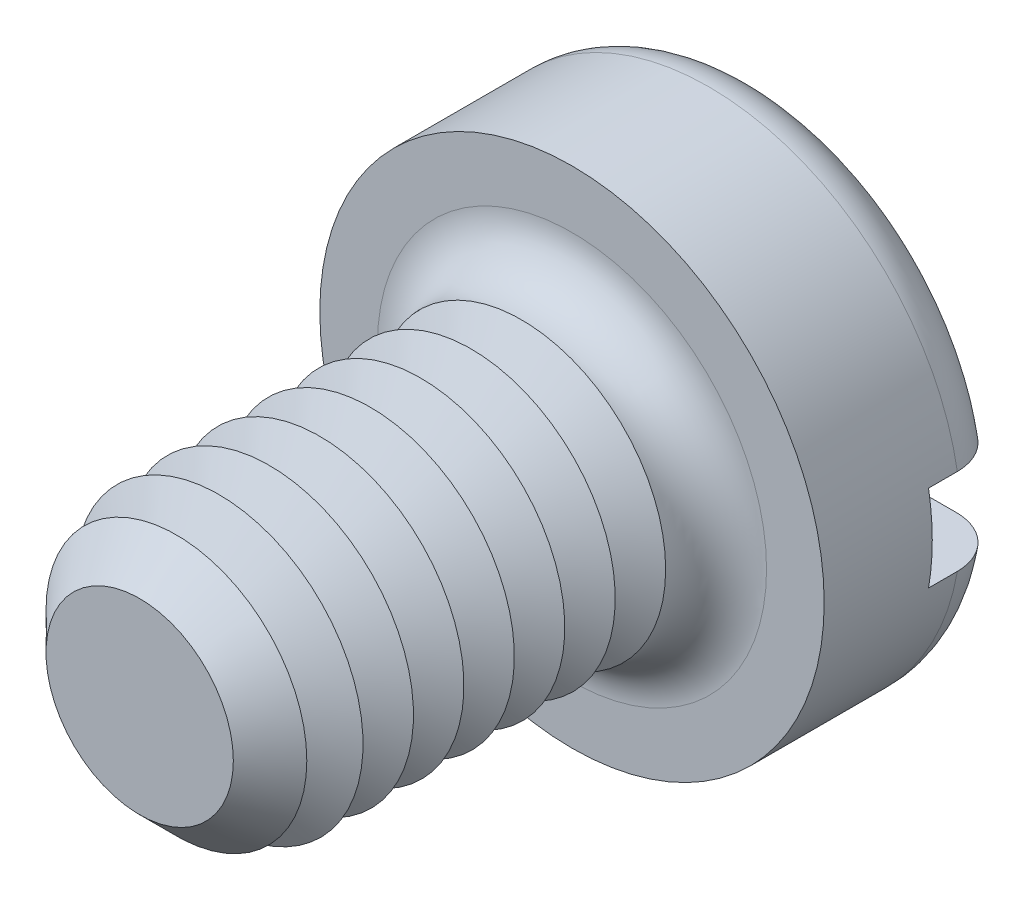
ISO-10303-21;
HEADER;
FILE_DESCRIPTION(('STEP AP214'),'2;1');
FILE_NAME('part.step','',(''),(''),'','','');
FILE_SCHEMA(('AUTOMOTIVE_DESIGN { 1 0 10303 214 1 1 1 1 }'));
ENDSEC;
DATA;
#1=APPLICATION_CONTEXT('core data for automotive mechanical design processes');
#2=APPLICATION_PROTOCOL_DEFINITION('international standard','automotive_design',2000,#1);
#3=PRODUCT_CONTEXT('',#1,'mechanical');
#4=PRODUCT('Part','Part','',(#3));
#5=PRODUCT_RELATED_PRODUCT_CATEGORY('part','',(#4));
#6=PRODUCT_DEFINITION_FORMATION('','',#4);
#7=PRODUCT_DEFINITION_CONTEXT('part definition',#1,'design');
#8=PRODUCT_DEFINITION('design','',#6,#7);
#9=PRODUCT_DEFINITION_SHAPE('','',#8);
#10=(LENGTH_UNIT() NAMED_UNIT(*) SI_UNIT(.MILLI.,.METRE.));
#11=(NAMED_UNIT(*) PLANE_ANGLE_UNIT() SI_UNIT($,.RADIAN.));
#12=(NAMED_UNIT(*) SI_UNIT($,.STERADIAN.) SOLID_ANGLE_UNIT());
#13=UNCERTAINTY_MEASURE_WITH_UNIT(LENGTH_MEASURE(1.E-05),#10,'distance_accuracy_value','');
#14=(GEOMETRIC_REPRESENTATION_CONTEXT(3) GLOBAL_UNCERTAINTY_ASSIGNED_CONTEXT((#13)) GLOBAL_UNIT_ASSIGNED_CONTEXT((#10,
#11,#12)) REPRESENTATION_CONTEXT('',''));
#15=CARTESIAN_POINT('',(0.,0.,0.));
#16=DIRECTION('',(0.,0.,1.));
#17=DIRECTION('',(1.,0.,0.));
#18=AXIS2_PLACEMENT_3D('',#15,#16,#17);
#19=CARTESIAN_POINT('',(0.,0.,-2.6));
#20=DIRECTION('',(0.,0.,1.));
#21=DIRECTION('',(1.,0.,0.));
#22=AXIS2_PLACEMENT_3D('',#19,#20,#21);
#23=PLANE('',#22);
#24=CARTESIAN_POINT('',(0.,0.,-2.6));
#25=DIRECTION('',(0.,0.,1.));
#26=DIRECTION('',(1.,0.,0.));
#27=AXIS2_PLACEMENT_3D('',#24,#25,#26);
#28=CIRCLE('',#27,2.8);
#29=CARTESIAN_POINT('',(-2.73495886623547,0.6,-2.6));
#30=VERTEX_POINT('',#29);
#31=CARTESIAN_POINT('',(2.73495886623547,0.6,-2.6));
#32=VERTEX_POINT('',#31);
#33=EDGE_CURVE('E116',#30,#32,#28,.F.);
#34=ORIENTED_EDGE('',*,*,#33,.T.);
#35=DIRECTION('',(1.,0.,0.));
#36=VECTOR('',#35,1.);
#37=CARTESIAN_POINT('',(-3.5,0.600000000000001,-2.6));
#38=LINE('',#37,#36);
#39=EDGE_CURVE('E111',#30,#32,#38,.T.);
#40=ORIENTED_EDGE('',*,*,#39,.F.);
#41=EDGE_LOOP('',(#34,#40));
#42=FACE_BOUND('',#41,.T.);
#43=ADVANCED_FACE('F39',(#42),#23,.F.);
#44=CARTESIAN_POINT('',(0.,0.,-1.9));
#45=DIRECTION('',(0.,0.,1.));
#46=DIRECTION('',(1.,0.,0.));
#47=AXIS2_PLACEMENT_3D('',#44,#45,#46);
#48=TOROIDAL_SURFACE('',#47,2.8,0.7);
#49=CARTESIAN_POINT('',(-3.24550494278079,0.600000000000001,-2.38938679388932));
#50=CARTESIAN_POINT('',(-3.21724139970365,0.600000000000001,-2.41780774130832));
#51=CARTESIAN_POINT('',(-3.18652103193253,0.600000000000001,-2.44383169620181));
#52=CARTESIAN_POINT('',(-3.12110229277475,0.600000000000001,-2.49034599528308));
#53=CARTESIAN_POINT('',(-3.08639834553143,0.6,-2.51082844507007));
#54=CARTESIAN_POINT('',(-3.01410013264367,0.6,-2.54568075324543));
#55=CARTESIAN_POINT('',(-2.97650963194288,0.6,-2.56005841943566));
#56=CARTESIAN_POINT('',(-2.89948250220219,0.6,-2.58239238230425));
#57=CARTESIAN_POINT('',(-2.86004633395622,0.6,-2.59035027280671));
#58=CARTESIAN_POINT('',(-2.77983715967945,0.6,-2.5997577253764));
#59=CARTESIAN_POINT('',(-2.73905311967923,0.6,-2.60111317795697));
#60=CARTESIAN_POINT('',(-2.65781876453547,0.6,-2.59706866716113));
#61=CARTESIAN_POINT('',(-2.61736849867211,0.6,-2.59166772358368));
#62=CARTESIAN_POINT('',(-2.53729983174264,0.6,-2.57414594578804));
#63=CARTESIAN_POINT('',(-2.49770360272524,0.6,-2.56192363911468));
#64=CARTESIAN_POINT('',(-2.421111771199,0.6,-2.5310238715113));
#65=CARTESIAN_POINT('',(-2.38411632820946,0.6,-2.51234601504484));
#66=CARTESIAN_POINT('',(-2.31371213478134,0.6,-2.46896762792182));
#67=CARTESIAN_POINT('',(-2.28031240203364,0.6,-2.44425244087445));
#68=CARTESIAN_POINT('',(-2.21823311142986,0.6,-2.38946667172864));
#69=CARTESIAN_POINT('',(-2.18955321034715,0.6,-2.35939647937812));
#70=CARTESIAN_POINT('',(-2.13836074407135,0.6,-2.29532787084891));
#71=CARTESIAN_POINT('',(-2.11574147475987,0.6,-2.26141482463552));
#72=CARTESIAN_POINT('',(-2.07677080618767,0.6,-2.19015935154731));
#73=CARTESIAN_POINT('',(-2.06041784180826,0.6,-2.15281778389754));
#74=CARTESIAN_POINT('',(-2.03508596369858,0.6,-2.07723332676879));
#75=CARTESIAN_POINT('',(-2.02585871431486,0.6,-2.03907365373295));
#76=CARTESIAN_POINT('',(-2.01416722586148,0.6,-1.96173417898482));
#77=CARTESIAN_POINT('',(-2.01170151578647,0.6,-1.92255460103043));
#78=CARTESIAN_POINT('',(-2.01359934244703,0.6,-1.84555709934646));
#79=CARTESIAN_POINT('',(-2.01775787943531,0.6,-1.80773393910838));
#80=CARTESIAN_POINT('',(-2.03236373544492,0.6,-1.73332511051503));
#81=CARTESIAN_POINT('',(-2.04281097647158,0.6,-1.69673942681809));
#82=CARTESIAN_POINT('',(-2.06962963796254,0.6,-1.62577336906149));
#83=CARTESIAN_POINT('',(-2.08600685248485,0.6,-1.59139519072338));
#84=CARTESIAN_POINT('',(-2.12413495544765,0.6,-1.52576356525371));
#85=CARTESIAN_POINT('',(-2.14588657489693,0.6,-1.49451054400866));
#86=CARTESIAN_POINT('',(-2.19483541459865,0.6,-1.43498643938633));
#87=CARTESIAN_POINT('',(-2.22217844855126,0.6,-1.40683532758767));
#88=CARTESIAN_POINT('',(-2.28105616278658,0.6,-1.35532544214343));
#89=CARTESIAN_POINT('',(-2.3125916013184,0.6,-1.33196753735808));
#90=CARTESIAN_POINT('',(-2.38018779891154,0.6,-1.28984356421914));
#91=CARTESIAN_POINT('',(-2.41637068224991,0.6,-1.27127330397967));
#92=CARTESIAN_POINT('',(-2.49129688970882,0.6,-1.24032971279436));
#93=CARTESIAN_POINT('',(-2.53004053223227,0.6,-1.22795715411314));
#94=CARTESIAN_POINT('',(-2.6098393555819,0.6,-1.2095515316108));
#95=CARTESIAN_POINT('',(-2.65092550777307,0.6,-1.20365237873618));
#96=CARTESIAN_POINT('',(-2.7335069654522,0.6,-1.1988380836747));
#97=CARTESIAN_POINT('',(-2.7750022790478,0.6,-1.19992308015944));
#98=CARTESIAN_POINT('',(-2.85718851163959,0.6,-1.20909046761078));
#99=CARTESIAN_POINT('',(-2.8978799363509,0.6,-1.21716830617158));
#100=CARTESIAN_POINT('',(-2.97729176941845,0.6,-1.24014327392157));
#101=CARTESIAN_POINT('',(-3.01601231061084,0.6,-1.25503994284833));
#102=CARTESIAN_POINT('',(-3.08976822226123,0.6,-1.29101066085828));
#103=CARTESIAN_POINT('',(-3.12484927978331,0.600000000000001,-1.31199098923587));
#104=CARTESIAN_POINT('',(-3.19090022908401,0.600000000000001,-1.35965144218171));
#105=CARTESIAN_POINT('',(-3.22187053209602,0.600000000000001,-1.38633099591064));
#106=CARTESIAN_POINT('',(-3.2781946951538,0.600000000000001,-1.44408564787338));
#107=CARTESIAN_POINT('',(-3.3036441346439,0.600000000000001,-1.47506754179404));
#108=CARTESIAN_POINT('',(-3.34887649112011,0.600000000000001,-1.54092398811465));
#109=CARTESIAN_POINT('',(-3.36865993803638,0.600000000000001,-1.57579817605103));
#110=CARTESIAN_POINT('',(-3.40166738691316,0.600000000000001,-1.64783067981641));
#111=CARTESIAN_POINT('',(-3.41499360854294,0.600000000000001,-1.68494217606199));
#112=CARTESIAN_POINT('',(-3.43515375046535,0.600000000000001,-1.76088675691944));
#113=CARTESIAN_POINT('',(-3.44198836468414,0.600000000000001,-1.79971965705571));
#114=CARTESIAN_POINT('',(-3.44891916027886,0.600000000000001,-1.87757893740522));
#115=CARTESIAN_POINT('',(-3.44908375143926,0.600000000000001,-1.91659924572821));
#116=CARTESIAN_POINT('',(-3.44284111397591,0.600000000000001,-1.99412088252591));
#117=CARTESIAN_POINT('',(-3.43643236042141,0.600000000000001,-2.03262208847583));
#118=CARTESIAN_POINT('',(-3.41725803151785,0.600000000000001,-2.10792315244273));
#119=CARTESIAN_POINT('',(-3.40450469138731,0.600000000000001,-2.14472613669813));
#120=CARTESIAN_POINT('',(-3.3730385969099,0.600000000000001,-2.21565060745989));
#121=CARTESIAN_POINT('',(-3.35433321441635,0.600000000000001,-2.24977534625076));
#122=CARTESIAN_POINT('',(-3.3201892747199,0.600000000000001,-2.30136364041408));
#123=CARTESIAN_POINT('',(-3.30647805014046,0.600000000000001,-2.31999402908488));
#124=CARTESIAN_POINT('',(-3.27728518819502,0.600000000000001,-2.35581090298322));
#125=CARTESIAN_POINT('',(-3.26180356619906,0.600000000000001,-2.37299740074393));
#126=CARTESIAN_POINT('',(-3.24550494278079,0.600000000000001,-2.38938679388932));
#127=B_SPLINE_CURVE_WITH_KNOTS('',3,(#49,#50,#51,#52,#53,#54,#55,#56,#57,#58,#59,#60,#61,#62,
#63,#64,#65,#66,#67,#68,#69,#70,#71,#72,#73,#74,#75,#76,#77,#78,#79,#80,#81,#82,#83,#84,#85,#86,
#87,#88,#89,#90,#91,#92,#93,#94,#95,#96,#97,#98,#99,#100,#101,#102,#103,#104,#105,#106,#107,
#108,#109,#110,#111,#112,#113,#114,#115,#116,#117,#118,#119,#120,#121,#122,#123,#124,#125,#126),
.UNSPECIFIED.,.T.,.F.,(4,2,2,2,2,2,2,2,2,2,2,2,2,2,2,2,2,2,2,2,2,2,2,2,2,2,2,2,2,2,2,2,2,2,2,2,
2,2,4),(0.,0.120160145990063,0.240490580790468,0.36066665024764,0.480812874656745,
0.602666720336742,0.724538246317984,0.848272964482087,0.972015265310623,1.09606100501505,
1.2200977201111,1.34178071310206,1.46343329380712,1.58062647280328,1.6977941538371,
1.81140573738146,1.92501591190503,2.03873739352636,2.15247435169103,2.26967910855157,
2.38690509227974,2.50835551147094,2.62982106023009,2.75375450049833,2.87769040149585,
3.00154567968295,3.12539259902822,3.24742469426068,3.36944457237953,3.48914477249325,
3.60883377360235,3.72656056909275,3.84427477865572,3.96078136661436,4.07731498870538,
4.19362474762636,4.3097910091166,4.37908387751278,4.44837614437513),.UNSPECIFIED.);
#128=CARTESIAN_POINT('',(-3.44818792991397,0.600000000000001,-1.8999999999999));
#129=VERTEX_POINT('',#128);
#130=EDGE_CURVE('E241',#129,#30,#127,.T.);
#131=ORIENTED_EDGE('',*,*,#130,.F.);
#132=CARTESIAN_POINT('',(0.,0.,-1.9));
#133=DIRECTION('',(0.,0.,1.));
#134=DIRECTION('',(1.,0.,0.));
#135=AXIS2_PLACEMENT_3D('',#132,#133,#134);
#136=CIRCLE('',#135,3.5);
#137=CARTESIAN_POINT('',(3.44818792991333,0.6,-1.9));
#138=VERTEX_POINT('',#137);
#139=EDGE_CURVE('E125',#138,#129,#136,.T.);
#140=ORIENTED_EDGE('',*,*,#139,.F.);
#141=CARTESIAN_POINT('',(2.1414268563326,0.6,-2.29762171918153));
#142=CARTESIAN_POINT('',(2.16505443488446,0.6,-2.33058245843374));
#143=CARTESIAN_POINT('',(2.19155609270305,0.6,-2.36152717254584));
#144=CARTESIAN_POINT('',(2.24942944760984,0.6,-2.41852964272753));
#145=CARTESIAN_POINT('',(2.28080921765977,0.6,-2.44457913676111));
#146=CARTESIAN_POINT('',(2.34741203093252,0.6,-2.49105381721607));
#147=CARTESIAN_POINT('',(2.38262862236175,0.6,-2.51148824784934));
#148=CARTESIAN_POINT('',(2.45593176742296,0.6,-2.54626881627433));
#149=CARTESIAN_POINT('',(2.49401741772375,0.6,-2.56061686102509));
#150=CARTESIAN_POINT('',(2.57272605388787,0.6,-2.58306429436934));
#151=CARTESIAN_POINT('',(2.6133821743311,0.6,-2.59104769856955));
#152=CARTESIAN_POINT('',(2.6954618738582,0.6,-2.60009608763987));
#153=CARTESIAN_POINT('',(2.73688552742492,0.6,-2.60116039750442));
#154=CARTESIAN_POINT('',(2.81941950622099,0.6,-2.5962925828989));
#155=CARTESIAN_POINT('',(2.86052888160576,0.6,-2.59034422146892));
#156=CARTESIAN_POINT('',(2.94113709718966,0.6,-2.57153687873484));
#157=CARTESIAN_POINT('',(2.98063603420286,0.6,-2.55867831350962));
#158=CARTESIAN_POINT('',(3.05633735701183,0.6,-2.52657771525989));
#159=CARTESIAN_POINT('',(3.09257627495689,0.6,-2.50742188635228));
#160=CARTESIAN_POINT('',(3.16123898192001,0.6,-2.46318606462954));
#161=CARTESIAN_POINT('',(3.19366316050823,0.6,-2.4381066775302));
#162=CARTESIAN_POINT('',(3.25312278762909,0.6,-2.38324481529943));
#163=CARTESIAN_POINT('',(3.28024842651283,0.6,-2.35356008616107));
#164=CARTESIAN_POINT('',(3.32902587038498,0.6,-2.28998971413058));
#165=CARTESIAN_POINT('',(3.35067820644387,0.6,-2.25610447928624));
#166=CARTESIAN_POINT('',(3.38751207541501,0.6,-2.18572286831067));
#167=CARTESIAN_POINT('',(3.40279804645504,0.6,-2.14928112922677));
#168=CARTESIAN_POINT('',(3.42695590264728,0.6,-2.07433042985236));
#169=CARTESIAN_POINT('',(3.43582824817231,0.6,-2.03582161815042));
#170=CARTESIAN_POINT('',(3.44682113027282,0.6,-1.95829536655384));
#171=CARTESIAN_POINT('',(3.44901648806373,0.6,-1.91928851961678));
#172=CARTESIAN_POINT('',(3.44680085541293,0.6,-1.84146366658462));
#173=CARTESIAN_POINT('',(3.44239008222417,0.6,-1.80264565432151));
#174=CARTESIAN_POINT('',(3.42712544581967,0.6,-1.72644634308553));
#175=CARTESIAN_POINT('',(3.41629508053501,0.6,-1.6890603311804));
#176=CARTESIAN_POINT('',(3.38853757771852,0.6,-1.61662604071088));
#177=CARTESIAN_POINT('',(3.37161039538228,0.6,-1.58157777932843));
#178=CARTESIAN_POINT('',(3.33207798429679,0.6,-1.51464178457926));
#179=CARTESIAN_POINT('',(3.30944854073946,0.6,-1.48276835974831));
#180=CARTESIAN_POINT('',(3.2592165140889,0.6,-1.42321861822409));
#181=CARTESIAN_POINT('',(3.23161370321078,0.6,-1.3955424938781));
#182=CARTESIAN_POINT('',(3.17188519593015,0.6,-1.34481834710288));
#183=CARTESIAN_POINT('',(3.13971065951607,0.6,-1.32182785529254));
#184=CARTESIAN_POINT('',(3.07201123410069,0.6,-1.28147003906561));
#185=CARTESIAN_POINT('',(3.03648608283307,0.6,-1.26410315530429));
#186=CARTESIAN_POINT('',(2.962449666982,0.6,-1.2351645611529));
#187=CARTESIAN_POINT('',(2.92389781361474,0.6,-1.22369671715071));
#188=CARTESIAN_POINT('',(2.84543273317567,0.6,-1.20726565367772));
#189=CARTESIAN_POINT('',(2.80551936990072,0.6,-1.20230308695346));
#190=CARTESIAN_POINT('',(2.72467191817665,0.6,-1.1989357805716));
#191=CARTESIAN_POINT('',(2.68373266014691,0.6,-1.20065484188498));
#192=CARTESIAN_POINT('',(2.60270222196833,0.6,-1.21084560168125));
#193=CARTESIAN_POINT('',(2.56261112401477,0.6,-1.21931795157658));
#194=CARTESIAN_POINT('',(2.48385954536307,0.6,-1.24292934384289));
#195=CARTESIAN_POINT('',(2.44522508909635,0.6,-1.25815531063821));
#196=CARTESIAN_POINT('',(2.37106165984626,0.6,-1.29488663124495));
#197=CARTESIAN_POINT('',(2.33553282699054,0.6,-1.31639226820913));
#198=CARTESIAN_POINT('',(2.2686996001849,0.6,-1.36507949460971));
#199=CARTESIAN_POINT('',(2.23738745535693,0.6,-1.39225042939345));
#200=CARTESIAN_POINT('',(2.17990424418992,0.6,-1.45157941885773));
#201=CARTESIAN_POINT('',(2.15373259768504,0.6,-1.48373691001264));
#202=CARTESIAN_POINT('',(2.10799355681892,0.6,-1.551327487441));
#203=CARTESIAN_POINT('',(2.08828258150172,0.6,-1.58666329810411));
#204=CARTESIAN_POINT('',(2.05534440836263,0.6,-1.66023600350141));
#205=CARTESIAN_POINT('',(2.042115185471,0.6,-1.6984719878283));
#206=CARTESIAN_POINT('',(2.02303126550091,0.6,-1.77519783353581));
#207=CARTESIAN_POINT('',(2.01691541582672,0.6,-1.8136228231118));
#208=CARTESIAN_POINT('',(2.01140375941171,0.6,-1.89096056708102));
#209=CARTESIAN_POINT('',(2.01200856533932,0.6,-1.92987336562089));
#210=CARTESIAN_POINT('',(2.01981617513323,0.6,-2.006065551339));
#211=CARTESIAN_POINT('',(2.02685835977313,0.6,-2.04336165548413));
#212=CARTESIAN_POINT('',(2.0470502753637,0.6,-2.1162250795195));
#213=CARTESIAN_POINT('',(2.06019252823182,0.6,-2.15179445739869));
#214=CARTESIAN_POINT('',(2.08525738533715,0.6,-2.20558874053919));
#215=CARTESIAN_POINT('',(2.09529161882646,0.6,-2.22471751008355));
#216=CARTESIAN_POINT('',(2.11708813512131,0.6,-2.26196179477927));
#217=CARTESIAN_POINT('',(2.12885034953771,0.6,-2.28007734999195));
#218=CARTESIAN_POINT('',(2.1414268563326,0.6,-2.29762171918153));
#219=B_SPLINE_CURVE_WITH_KNOTS('',3,(#141,#142,#143,#144,#145,#146,#147,#148,#149,#150,#151,
#152,#153,#154,#155,#156,#157,#158,#159,#160,#161,#162,#163,#164,#165,#166,#167,#168,#169,#170,
#171,#172,#173,#174,#175,#176,#177,#178,#179,#180,#181,#182,#183,#184,#185,#186,#187,#188,#189,
#190,#191,#192,#193,#194,#195,#196,#197,#198,#199,#200,#201,#202,#203,#204,#205,#206,#207,#208,
#209,#210,#211,#212,#213,#214,#215,#216,#217,#218),.UNSPECIFIED.,.T.,.F.,(4,2,2,2,2,2,2,2,2,2,2,
2,2,2,2,2,2,2,2,2,2,2,2,2,2,2,2,2,2,2,2,2,2,2,2,2,2,2,4),(0.,0.121582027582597,
0.243367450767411,0.364951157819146,0.486496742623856,0.610209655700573,0.733934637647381,
0.857946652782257,0.981951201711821,1.1043243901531,1.22668507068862,1.34673532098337,
1.46677391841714,1.58475736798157,1.70273234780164,1.81938035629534,1.93602452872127,
2.05224435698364,2.168465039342,2.28518782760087,2.40191596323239,2.52000081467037,
2.63809491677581,2.75820270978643,2.87832255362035,3.00067856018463,3.1230463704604,
3.24703703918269,3.37103329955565,3.49479843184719,3.6185495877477,3.73932715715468,
3.86006696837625,3.9762182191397,4.09238005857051,4.2057203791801,4.31892212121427,
4.38364046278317,4.44835624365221),.UNSPECIFIED.);
#220=EDGE_CURVE('E243',#32,#138,#219,.T.);
#221=ORIENTED_EDGE('',*,*,#220,.F.);
#222=ORIENTED_EDGE('',*,*,#33,.F.);
#223=EDGE_LOOP('',(#131,#140,#221,#222));
#224=FACE_BOUND('',#223,.T.);
#225=ADVANCED_FACE('F225',(#224),#48,.T.);
#226=CARTESIAN_POINT('',(0.,0.,-2.6));
#227=DIRECTION('',(0.,0.,1.));
#228=DIRECTION('',(1.,0.,0.));
#229=AXIS2_PLACEMENT_3D('',#226,#227,#228);
#230=CYLINDRICAL_SURFACE('',#229,3.5);
#231=DIRECTION('',(0.,0.,1.));
#232=VECTOR('',#231,1.);
#233=CARTESIAN_POINT('',(3.44818792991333,0.6,-2.6));
#234=LINE('',#233,#232);
#235=CARTESIAN_POINT('',(3.44818792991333,0.6,-1.5));
#236=VERTEX_POINT('',#235);
#237=EDGE_CURVE('E257',#138,#236,#234,.T.);
#238=ORIENTED_EDGE('',*,*,#237,.F.);
#239=ORIENTED_EDGE('',*,*,#139,.T.);
#240=DIRECTION('',(0.,0.,1.));
#241=VECTOR('',#240,1.);
#242=CARTESIAN_POINT('',(-3.44818792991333,0.600000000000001,-2.6));
#243=LINE('',#242,#241);
#244=CARTESIAN_POINT('',(-3.44818792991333,0.600000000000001,-1.5));
#245=VERTEX_POINT('',#244);
#246=EDGE_CURVE('E63',#245,#129,#243,.F.);
#247=ORIENTED_EDGE('',*,*,#246,.F.);
#248=CARTESIAN_POINT('',(0.,0.,-1.5));
#249=DIRECTION('',(0.,0.,-1.));
#250=DIRECTION('',(-1.,0.,0.));
#251=AXIS2_PLACEMENT_3D('',#248,#249,#250);
#252=CIRCLE('',#251,3.5);
#253=CARTESIAN_POINT('',(-3.44818792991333,-0.599999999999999,-1.5));
#254=VERTEX_POINT('',#253);
#255=EDGE_CURVE('E43',#245,#254,#252,.F.);
#256=ORIENTED_EDGE('',*,*,#255,.T.);
#257=DIRECTION('',(0.,0.,1.));
#258=VECTOR('',#257,1.);
#259=CARTESIAN_POINT('',(-3.44818792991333,-0.599999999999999,-2.6));
#260=LINE('',#259,#258);
#261=CARTESIAN_POINT('',(-3.44818792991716,-0.599999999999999,-1.90000000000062));
#262=VERTEX_POINT('',#261);
#263=EDGE_CURVE('E254',#262,#254,#260,.T.);
#264=ORIENTED_EDGE('',*,*,#263,.F.);
#265=CARTESIAN_POINT('',(3.44818792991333,-0.6,-1.9));
#266=VERTEX_POINT('',#265);
#267=EDGE_CURVE('E127',#262,#266,#136,.T.);
#268=ORIENTED_EDGE('',*,*,#267,.T.);
#269=DIRECTION('',(0.,0.,1.));
#270=VECTOR('',#269,1.);
#271=CARTESIAN_POINT('',(3.44818792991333,-0.6,-2.6));
#272=LINE('',#271,#270);
#273=CARTESIAN_POINT('',(3.44818792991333,-0.6,-1.5));
#274=VERTEX_POINT('',#273);
#275=EDGE_CURVE('E55',#274,#266,#272,.F.);
#276=ORIENTED_EDGE('',*,*,#275,.F.);
#277=EDGE_CURVE('E11',#274,#236,#252,.F.);
#278=ORIENTED_EDGE('',*,*,#277,.T.);
#279=EDGE_LOOP('',(#238,#239,#247,#256,#264,#268,#276,#278));
#280=FACE_BOUND('',#279,.T.);
#281=CARTESIAN_POINT('',(0.,0.,0.));
#282=DIRECTION('',(0.,0.,1.));
#283=DIRECTION('',(1.,0.,0.));
#284=AXIS2_PLACEMENT_3D('',#281,#282,#283);
#285=CIRCLE('',#284,3.5);
#286=CARTESIAN_POINT('',(3.5,0.,0.));
#287=VERTEX_POINT('',#286);
#288=EDGE_CURVE('E259',#287,#287,#285,.T.);
#289=ORIENTED_EDGE('',*,*,#288,.F.);
#290=EDGE_LOOP('',(#289));
#291=FACE_BOUND('',#290,.T.);
#292=ADVANCED_FACE('F221',(#280,#291),#230,.T.);
#293=CARTESIAN_POINT('',(2.73495886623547,-0.6,-2.6));
#294=VERTEX_POINT('',#293);
#295=CARTESIAN_POINT('',(-2.73495886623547,-0.6,-2.6));
#296=VERTEX_POINT('',#295);
#297=EDGE_CURVE('E109',#294,#296,#28,.F.);
#298=ORIENTED_EDGE('',*,*,#297,.T.);
#299=DIRECTION('',(-1.,0.,0.));
#300=VECTOR('',#299,1.);
#301=CARTESIAN_POINT('',(-3.5,-0.599999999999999,-2.6));
#302=LINE('',#301,#300);
#303=EDGE_CURVE('E96',#294,#296,#302,.T.);
#304=ORIENTED_EDGE('',*,*,#303,.F.);
#305=EDGE_LOOP('',(#298,#304));
#306=FACE_BOUND('',#305,.T.);
#307=ADVANCED_FACE('F108',(#306),#23,.F.);
#308=CARTESIAN_POINT('',(0.,0.,0.));
#309=DIRECTION('',(0.,0.,1.));
#310=DIRECTION('',(1.,0.,0.));
#311=AXIS2_PLACEMENT_3D('',#308,#309,#310);
#312=PLANE('',#311);
#313=CARTESIAN_POINT('',(0.,0.,0.));
#314=DIRECTION('',(0.,0.,1.));
#315=DIRECTION('',(1.,0.,0.));
#316=AXIS2_PLACEMENT_3D('',#313,#314,#315);
#317=CIRCLE('',#316,2.7);
#318=CARTESIAN_POINT('',(2.7,0.,0.));
#319=VERTEX_POINT('',#318);
#320=EDGE_CURVE('E115',#319,#319,#317,.F.);
#321=ORIENTED_EDGE('',*,*,#320,.T.);
#322=EDGE_LOOP('',(#321));
#323=FACE_BOUND('',#322,.T.);
#324=ORIENTED_EDGE('',*,*,#288,.T.);
#325=EDGE_LOOP('',(#324));
#326=FACE_BOUND('',#325,.T.);
#327=ADVANCED_FACE('F220',(#323,#326),#312,.T.);
#328=CARTESIAN_POINT('',(-3.24550494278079,-0.599999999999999,-2.38938679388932));
#329=CARTESIAN_POINT('',(-3.27309693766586,-0.599999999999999,-2.36163611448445));
#330=CARTESIAN_POINT('',(-3.29838741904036,-0.599999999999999,-2.3315608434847));
#331=CARTESIAN_POINT('',(-3.34359429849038,-0.599999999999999,-2.26757659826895));
#332=CARTESIAN_POINT('',(-3.36350518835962,-0.599999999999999,-2.23366374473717));
#333=CARTESIAN_POINT('',(-3.39733065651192,-0.599999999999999,-2.16296274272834));
#334=CARTESIAN_POINT('',(-3.4112451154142,-0.599999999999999,-2.12617453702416));
#335=CARTESIAN_POINT('',(-3.43264462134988,-0.599999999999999,-2.05078178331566));
#336=CARTESIAN_POINT('',(-3.44013114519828,-0.599999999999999,-2.01217765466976));
#337=CARTESIAN_POINT('',(-3.44841975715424,-0.599999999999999,-1.9345391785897));
#338=CARTESIAN_POINT('',(-3.44926944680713,-0.599999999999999,-1.89550990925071));
#339=CARTESIAN_POINT('',(-3.44438358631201,-0.599999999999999,-1.81786552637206));
#340=CARTESIAN_POINT('',(-3.43864801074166,-0.599999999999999,-1.77925041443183));
#341=CARTESIAN_POINT('',(-3.42079221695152,-0.599999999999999,-1.70364264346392));
#342=CARTESIAN_POINT('',(-3.40869011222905,-0.599999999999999,-1.66664570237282));
#343=CARTESIAN_POINT('',(-3.37847692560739,-0.599999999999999,-1.59519424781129));
#344=CARTESIAN_POINT('',(-3.3603657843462,-0.599999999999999,-1.56073975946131));
#345=CARTESIAN_POINT('',(-3.31856549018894,-0.599999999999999,-1.4951524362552));
#346=CARTESIAN_POINT('',(-3.29484830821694,-0.599999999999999,-1.46403747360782));
#347=CARTESIAN_POINT('',(-3.24258489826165,-0.599999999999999,-1.40617131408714));
#348=CARTESIAN_POINT('',(-3.21403843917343,-0.599999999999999,-1.37942032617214));
#349=CARTESIAN_POINT('',(-3.15256084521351,-0.599999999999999,-1.33067963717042));
#350=CARTESIAN_POINT('',(-3.11958015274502,-0.599999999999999,-1.30875246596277));
#351=CARTESIAN_POINT('',(-3.0504559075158,-0.599999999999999,-1.27063718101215));
#352=CARTESIAN_POINT('',(-3.01431209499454,-0.6,-1.25444953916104));
#353=CARTESIAN_POINT('',(-2.93921710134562,-0.6,-1.22796796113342));
#354=CARTESIAN_POINT('',(-2.90022796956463,-0.6,-1.217781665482));
#355=CARTESIAN_POINT('',(-2.82110512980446,-0.6,-1.20396915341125));
#356=CARTESIAN_POINT('',(-2.7809713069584,-0.6,-1.2003435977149));
#357=CARTESIAN_POINT('',(-2.69990924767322,-0.6,-1.19969717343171));
#358=CARTESIAN_POINT('',(-2.65898001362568,-0.6,-1.20279937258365));
#359=CARTESIAN_POINT('',(-2.57819986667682,-0.6,-1.21574287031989));
#360=CARTESIAN_POINT('',(-2.53834905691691,-0.6,-1.22558481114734));
#361=CARTESIAN_POINT('',(-2.46035232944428,-0.6,-1.25189361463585));
#362=CARTESIAN_POINT('',(-2.42223314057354,-0.6,-1.2684398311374));
#363=CARTESIAN_POINT('',(-2.34932316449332,-0.6,-1.30771928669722));
#364=CARTESIAN_POINT('',(-2.31453248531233,-0.6,-1.33045272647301));
#365=CARTESIAN_POINT('',(-2.24945577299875,-0.6,-1.38141543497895));
#366=CARTESIAN_POINT('',(-2.21915255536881,-0.6,-1.40962272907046));
#367=CARTESIAN_POINT('',(-2.16386461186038,-0.6,-1.47084552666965));
#368=CARTESIAN_POINT('',(-2.13887916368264,-0.6,-1.50386037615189));
#369=CARTESIAN_POINT('',(-2.09568071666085,-0.6,-1.57285917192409));
#370=CARTESIAN_POINT('',(-2.07730739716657,-0.6,-1.60874263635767));
#371=CARTESIAN_POINT('',(-2.04712019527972,-0.6,-1.68316975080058));
#372=CARTESIAN_POINT('',(-2.03530452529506,-0.6,-1.72171267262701));
#373=CARTESIAN_POINT('',(-2.01901751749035,-0.6,-1.79878952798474));
#374=CARTESIAN_POINT('',(-2.01428434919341,-0.6,-1.8372682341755));
#375=CARTESIAN_POINT('',(-2.01150652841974,-0.6,-1.91446369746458));
#376=CARTESIAN_POINT('',(-2.01346084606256,-0.6,-1.95318041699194));
#377=CARTESIAN_POINT('',(-2.02386268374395,-0.6,-2.0288619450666));
#378=CARTESIAN_POINT('',(-2.03216724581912,-0.6,-2.06584654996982));
#379=CARTESIAN_POINT('',(-2.05479337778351,-0.6,-2.13792373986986));
#380=CARTESIAN_POINT('',(-2.06911522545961,-0.6,-2.1730162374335));
#381=CARTESIAN_POINT('',(-2.10349906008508,-0.6,-2.24081034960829));
#382=CARTESIAN_POINT('',(-2.12363007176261,-0.6,-2.27347689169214));
#383=CARTESIAN_POINT('',(-2.16891308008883,-0.6,-2.33511902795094));
#384=CARTESIAN_POINT('',(-2.19406590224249,-0.6,-2.36409401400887));
#385=CARTESIAN_POINT('',(-2.24962389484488,-0.6,-2.41861972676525));
#386=CARTESIAN_POINT('',(-2.28018314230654,-0.6,-2.44401345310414));
#387=CARTESIAN_POINT('',(-2.34501720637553,-0.6,-2.48950558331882));
#388=CARTESIAN_POINT('',(-2.37929266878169,-0.6,-2.50960306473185));
#389=CARTESIAN_POINT('',(-2.45179417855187,-0.6,-2.54458276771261));
#390=CARTESIAN_POINT('',(-2.49011248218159,-0.6,-2.55927401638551));
#391=CARTESIAN_POINT('',(-2.56865227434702,-0.6,-2.58211133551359));
#392=CARTESIAN_POINT('',(-2.60887386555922,-0.6,-2.59025705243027));
#393=CARTESIAN_POINT('',(-2.69064746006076,-0.6,-2.59982905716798));
#394=CARTESIAN_POINT('',(-2.73220999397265,-0.6,-2.60116580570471));
#395=CARTESIAN_POINT('',(-2.81497658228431,-0.6,-2.59679700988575));
#396=CARTESIAN_POINT('',(-2.85618055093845,-0.6,-2.59108982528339));
#397=CARTESIAN_POINT('',(-2.93677683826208,-0.6,-2.57279487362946));
#398=CARTESIAN_POINT('',(-2.97617834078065,-0.6,-2.56024753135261));
#399=CARTESIAN_POINT('',(-3.05222242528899,-0.6,-2.52860709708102));
#400=CARTESIAN_POINT('',(-3.08886850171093,-0.599999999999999,-2.50952247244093));
#401=CARTESIAN_POINT('',(-3.14562501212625,-0.599999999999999,-2.47340693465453));
#402=CARTESIAN_POINT('',(-3.16689358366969,-0.599999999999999,-2.45816337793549));
#403=CARTESIAN_POINT('',(-3.20761866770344,-0.599999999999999,-2.42542115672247));
#404=CARTESIAN_POINT('',(-3.22707520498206,-0.599999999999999,-2.40792252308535));
#405=CARTESIAN_POINT('',(-3.24550494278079,-0.599999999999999,-2.38938679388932));
#406=B_SPLINE_CURVE_WITH_KNOTS('',3,(#328,#329,#330,#331,#332,#333,#334,#335,#336,#337,#338,
#339,#340,#341,#342,#343,#344,#345,#346,#347,#348,#349,#350,#351,#352,#353,#354,#355,#356,#357,
#358,#359,#360,#361,#362,#363,#364,#365,#366,#367,#368,#369,#370,#371,#372,#373,#374,#375,#376,
#377,#378,#379,#380,#381,#382,#383,#384,#385,#386,#387,#388,#389,#390,#391,#392,#393,#394,#395,
#396,#397,#398,#399,#400,#401,#402,#403,#404,#405),.UNSPECIFIED.,.T.,.F.,(4,2,2,2,2,2,2,2,2,2,2,
2,2,2,2,2,2,2,2,2,2,2,2,2,2,2,2,2,2,2,2,2,2,2,2,2,2,2,4),(0.,0.117306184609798,
0.234732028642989,0.352160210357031,0.469561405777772,0.586119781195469,0.702678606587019,
0.818907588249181,0.935137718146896,1.05196174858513,1.1687913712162,1.2870562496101,
1.40533084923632,1.52566688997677,1.64601504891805,1.76858322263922,1.89116307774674,
2.01523830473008,2.13931755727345,2.26290863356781,2.38648291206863,2.50681878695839,
2.62712184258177,2.74285697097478,2.85857427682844,2.97176054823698,3.08495204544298,
3.19954814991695,3.31416310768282,3.43282436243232,3.55150627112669,3.67404987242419,
3.79660009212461,3.92075778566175,4.04494439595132,4.16840490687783,4.29170610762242,
4.3700604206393,4.44841366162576),.UNSPECIFIED.);
#407=EDGE_CURVE('E103',#296,#262,#406,.T.);
#408=ORIENTED_EDGE('',*,*,#407,.F.);
#409=ORIENTED_EDGE('',*,*,#297,.F.);
#410=CARTESIAN_POINT('',(2.1414268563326,-0.6,-2.29762171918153));
#411=CARTESIAN_POINT('',(2.11900044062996,-0.6,-2.26633119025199));
#412=CARTESIAN_POINT('',(2.09913154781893,-0.6,-2.23318080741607));
#413=CARTESIAN_POINT('',(2.06517900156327,-0.6,-2.16401111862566));
#414=CARTESIAN_POINT('',(2.05109968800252,-0.6,-2.12798968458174));
#415=CARTESIAN_POINT('',(2.02923593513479,-0.6,-2.05404277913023));
#416=CARTESIAN_POINT('',(2.02145692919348,-0.6,-2.01611569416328));
#417=CARTESIAN_POINT('',(2.01251710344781,-0.6,-1.93949649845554));
#418=CARTESIAN_POINT('',(2.01135461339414,-0.6,-1.90080458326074));
#419=CARTESIAN_POINT('',(2.01564803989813,-0.6,-1.82450508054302));
#420=CARTESIAN_POINT('',(2.02098305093,-0.6,-1.78689061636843));
#421=CARTESIAN_POINT('',(2.03786826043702,-0.6,-1.71308589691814));
#422=CARTESIAN_POINT('',(2.04941870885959,-0.6,-1.67689569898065));
#423=CARTESIAN_POINT('',(2.07838664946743,-0.6,-1.60676639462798));
#424=CARTESIAN_POINT('',(2.09582944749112,-0.6,-1.57283776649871));
#425=CARTESIAN_POINT('',(2.1359925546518,-0.6,-1.50826612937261));
#426=CARTESIAN_POINT('',(2.15871360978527,-0.6,-1.47762358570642));
#427=CARTESIAN_POINT('',(2.20955413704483,-0.6,-1.41943384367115));
#428=CARTESIAN_POINT('',(2.23782364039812,-0.6,-1.39201777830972));
#429=CARTESIAN_POINT('',(2.29842612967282,-0.6,-1.34212199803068));
#430=CARTESIAN_POINT('',(2.33075984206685,-0.6,-1.31964316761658));
#431=CARTESIAN_POINT('',(2.399806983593,-0.6,-1.27945238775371));
#432=CARTESIAN_POINT('',(2.43663466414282,-0.6,-1.26193653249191));
#433=CARTESIAN_POINT('',(2.51267241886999,-0.6,-1.23320660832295));
#434=CARTESIAN_POINT('',(2.55188277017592,-0.6,-1.22199327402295));
#435=CARTESIAN_POINT('',(2.63235000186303,-0.6,-1.20602688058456));
#436=CARTESIAN_POINT('',(2.673631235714,-0.6,-1.20139617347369));
#437=CARTESIAN_POINT('',(2.7563863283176,-0.6,-1.19914622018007));
#438=CARTESIAN_POINT('',(2.79786018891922,-0.6,-1.20152704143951));
#439=CARTESIAN_POINT('',(2.87971192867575,-0.6,-1.21326884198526));
#440=CARTESIAN_POINT('',(2.92009214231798,-0.6,-1.22261349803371));
#441=CARTESIAN_POINT('',(2.99866777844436,-0.6,-1.24805614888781));
#442=CARTESIAN_POINT('',(3.03686335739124,-0.6,-1.26415365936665));
#443=CARTESIAN_POINT('',(3.10934738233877,-0.6,-1.3023912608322));
#444=CARTESIAN_POINT('',(3.14368704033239,-0.6,-1.32443423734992));
#445=CARTESIAN_POINT('',(3.20808395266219,-0.6,-1.37407725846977));
#446=CARTESIAN_POINT('',(3.23814164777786,-0.6,-1.40167673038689));
#447=CARTESIAN_POINT('',(3.29251534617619,-0.6,-1.46108303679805));
#448=CARTESIAN_POINT('',(3.3169296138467,-0.6,-1.49279994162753));
#449=CARTESIAN_POINT('',(3.35998418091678,-0.6,-1.55993706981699));
#450=CARTESIAN_POINT('',(3.37862502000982,-0.6,-1.59535694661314));
#451=CARTESIAN_POINT('',(3.40930212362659,-0.6,-1.668283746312));
#452=CARTESIAN_POINT('',(3.42143897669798,-0.6,-1.70574837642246));
#453=CARTESIAN_POINT('',(3.43918305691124,-0.6,-1.78219297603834));
#454=CARTESIAN_POINT('',(3.44479069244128,-0.6,-1.82117285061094));
#455=CARTESIAN_POINT('',(3.44928173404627,-0.6,-1.89914596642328));
#456=CARTESIAN_POINT('',(3.44822835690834,-0.6,-1.93813558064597));
#457=CARTESIAN_POINT('',(3.43957811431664,-0.6,-2.0153811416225));
#458=CARTESIAN_POINT('',(3.43198139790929,-0.6,-2.05363710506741));
#459=CARTESIAN_POINT('',(3.41049386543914,-0.6,-2.12826741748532));
#460=CARTESIAN_POINT('',(3.39661362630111,-0.6,-2.16464481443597));
#461=CARTESIAN_POINT('',(3.36297924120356,-0.6,-2.23457274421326));
#462=CARTESIAN_POINT('',(3.34322499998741,-0.6,-2.26812323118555));
#463=CARTESIAN_POINT('',(3.29828706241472,-0.6,-2.33167864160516));
#464=CARTESIAN_POINT('',(3.27307040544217,-0.6,-2.36166024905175));
#465=CARTESIAN_POINT('',(3.21802069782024,-0.6,-2.41703165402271));
#466=CARTESIAN_POINT('',(3.18818738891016,-0.6,-2.44242119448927));
#467=CARTESIAN_POINT('',(3.12433871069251,-0.6,-2.48825551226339));
#468=CARTESIAN_POINT('',(3.09027338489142,-0.6,-2.50863067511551));
#469=CARTESIAN_POINT('',(3.01925175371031,-0.6,-2.54348754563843));
#470=CARTESIAN_POINT('',(2.982295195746,-0.6,-2.55796873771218));
#471=CARTESIAN_POINT('',(2.90583499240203,-0.6,-2.58090526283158));
#472=CARTESIAN_POINT('',(2.86629758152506,-0.6,-2.58924801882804));
#473=CARTESIAN_POINT('',(2.78639041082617,-0.6,-2.59930573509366));
#474=CARTESIAN_POINT('',(2.7460205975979,-0.6,-2.60102026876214));
#475=CARTESIAN_POINT('',(2.66482039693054,-0.6,-2.59779078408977));
#476=CARTESIAN_POINT('',(2.62399477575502,-0.6,-2.59272651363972));
#477=CARTESIAN_POINT('',(2.54373809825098,-0.6,-2.57588976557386));
#478=CARTESIAN_POINT('',(2.50430750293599,-0.6,-2.56411509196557));
#479=CARTESIAN_POINT('',(2.42753167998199,-0.6,-2.53401488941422));
#480=CARTESIAN_POINT('',(2.39021407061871,-0.6,-2.51561892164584));
#481=CARTESIAN_POINT('',(2.31925431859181,-0.6,-2.4727929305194));
#482=CARTESIAN_POINT('',(2.28560806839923,-0.6,-2.44836975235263));
#483=CARTESIAN_POINT('',(2.23316677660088,-0.6,-2.40295212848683));
#484=CARTESIAN_POINT('',(2.21309339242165,-0.6,-2.38341311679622));
#485=CARTESIAN_POINT('',(2.17537212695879,-0.6,-2.34211733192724));
#486=CARTESIAN_POINT('',(2.1577241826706,-0.6,-2.32036061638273));
#487=CARTESIAN_POINT('',(2.1414268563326,-0.6,-2.29762171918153));
#488=B_SPLINE_CURVE_WITH_KNOTS('',3,(#410,#411,#412,#413,#414,#415,#416,#417,#418,#419,#420,
#421,#422,#423,#424,#425,#426,#427,#428,#429,#430,#431,#432,#433,#434,#435,#436,#437,#438,#439,
#440,#441,#442,#443,#444,#445,#446,#447,#448,#449,#450,#451,#452,#453,#454,#455,#456,#457,#458,
#459,#460,#461,#462,#463,#464,#465,#466,#467,#468,#469,#470,#471,#472,#473,#474,#475,#476,#477,
#478,#479,#480,#481,#482,#483,#484,#485,#486,#487),.UNSPECIFIED.,.T.,.F.,(4,2,2,2,2,2,2,2,2,2,2,
2,2,2,2,2,2,2,2,2,2,2,2,2,2,2,2,2,2,2,2,2,2,2,2,2,2,2,4),(0.,0.115394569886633,
0.230875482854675,0.346455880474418,0.462007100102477,0.575440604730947,0.688878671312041,
0.802810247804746,0.91675793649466,1.03436780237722,1.15199872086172,1.27377854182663,
1.39557255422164,1.51960202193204,1.64363268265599,1.76737352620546,1.89110549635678,
2.01292743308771,2.13473682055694,2.25423121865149,2.37371444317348,2.49129215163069,
2.60886250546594,2.72531873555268,2.8417723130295,2.95803059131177,3.07429075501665,
3.19127301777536,3.30826182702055,3.42679321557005,3.54533497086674,3.66599996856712,
3.78667273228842,3.90951478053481,4.03239705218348,4.15662720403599,4.28071691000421,
4.36457658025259,4.44843407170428),.UNSPECIFIED.);
#489=EDGE_CURVE('E92',#266,#294,#488,.T.);
#490=ORIENTED_EDGE('',*,*,#489,.F.);
#491=ORIENTED_EDGE('',*,*,#267,.F.);
#492=EDGE_LOOP('',(#408,#409,#490,#491));
#493=FACE_BOUND('',#492,.T.);
#494=ADVANCED_FACE('F113',(#493),#48,.T.);
#495=CARTESIAN_POINT('',(0.,0.,0.7));
#496=DIRECTION('',(0.,0.,1.));
#497=DIRECTION('',(1.,0.,0.));
#498=AXIS2_PLACEMENT_3D('',#495,#496,#497);
#499=TOROIDAL_SURFACE('',#498,2.7,0.7);
#500=ORIENTED_EDGE('',*,*,#320,.F.);
#501=EDGE_LOOP('',(#500));
#502=FACE_BOUND('',#501,.T.);
#503=CARTESIAN_POINT('',(0.,0.,0.7));
#504=DIRECTION('',(0.,0.,-1.));
#505=DIRECTION('',(-1.,0.,0.));
#506=AXIS2_PLACEMENT_3D('',#503,#504,#505);
#507=CIRCLE('',#506,2.);
#508=CARTESIAN_POINT('',(-2.,0.,0.7));
#509=VERTEX_POINT('',#508);
#510=EDGE_CURVE('E264',#509,#509,#507,.T.);
#511=ORIENTED_EDGE('',*,*,#510,.T.);
#512=EDGE_LOOP('',(#511));
#513=FACE_BOUND('',#512,.T.);
#514=ADVANCED_FACE('F213',(#502,#513),#499,.F.);
#515=CARTESIAN_POINT('',(0.,0.,1.05));
#516=DIRECTION('',(0.,0.,-1.));
#517=DIRECTION('',(-1.,0.,0.));
#518=AXIS2_PLACEMENT_3D('',#515,#516,#517);
#519=CONICAL_SURFACE('',#518,1.39378221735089,1.0471975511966);
#520=ORIENTED_EDGE('',*,*,#510,.F.);
#521=EDGE_LOOP('',(#520));
#522=FACE_BOUND('',#521,.T.);
#523=CARTESIAN_POINT('',(0.,0.,1.05));
#524=DIRECTION('',(0.,0.,-1.));
#525=DIRECTION('',(-1.,0.,0.));
#526=AXIS2_PLACEMENT_3D('',#523,#524,#525);
#527=CIRCLE('',#526,1.39378221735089);
#528=CARTESIAN_POINT('',(-1.39378221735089,0.,1.05));
#529=VERTEX_POINT('',#528);
#530=EDGE_CURVE('E268',#529,#529,#527,.T.);
#531=ORIENTED_EDGE('',*,*,#530,.T.);
#532=EDGE_LOOP('',(#531));
#533=FACE_BOUND('',#532,.T.);
#534=ADVANCED_FACE('F209',(#522,#533),#519,.T.);
#535=CARTESIAN_POINT('',(0.,0.,1.4));
#536=DIRECTION('',(0.,0.,1.));
#537=DIRECTION('',(1.,0.,0.));
#538=AXIS2_PLACEMENT_3D('',#535,#536,#537);
#539=CONICAL_SURFACE('',#538,2.,1.0471975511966);
#540=ORIENTED_EDGE('',*,*,#530,.F.);
#541=EDGE_LOOP('',(#540));
#542=FACE_BOUND('',#541,.T.);
#543=CARTESIAN_POINT('',(0.,0.,1.4));
#544=DIRECTION('',(0.,0.,-1.));
#545=DIRECTION('',(-1.,0.,0.));
#546=AXIS2_PLACEMENT_3D('',#543,#544,#545);
#547=CIRCLE('',#546,2.);
#548=CARTESIAN_POINT('',(-2.,0.,1.4));
#549=VERTEX_POINT('',#548);
#550=EDGE_CURVE('E274',#549,#549,#547,.T.);
#551=ORIENTED_EDGE('',*,*,#550,.T.);
#552=EDGE_LOOP('',(#551));
#553=FACE_BOUND('',#552,.T.);
#554=ADVANCED_FACE('F205',(#542,#553),#539,.T.);
#555=CARTESIAN_POINT('',(0.,0.,1.75));
#556=DIRECTION('',(0.,0.,-1.));
#557=DIRECTION('',(-1.,0.,0.));
#558=AXIS2_PLACEMENT_3D('',#555,#556,#557);
#559=CONICAL_SURFACE('',#558,1.39378221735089,1.0471975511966);
#560=ORIENTED_EDGE('',*,*,#550,.F.);
#561=EDGE_LOOP('',(#560));
#562=FACE_BOUND('',#561,.T.);
#563=CARTESIAN_POINT('',(0.,0.,1.75));
#564=DIRECTION('',(0.,0.,-1.));
#565=DIRECTION('',(-1.,0.,0.));
#566=AXIS2_PLACEMENT_3D('',#563,#564,#565);
#567=CIRCLE('',#566,1.39378221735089);
#568=CARTESIAN_POINT('',(-1.39378221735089,0.,1.75));
#569=VERTEX_POINT('',#568);
#570=EDGE_CURVE('E278',#569,#569,#567,.T.);
#571=ORIENTED_EDGE('',*,*,#570,.T.);
#572=EDGE_LOOP('',(#571));
#573=FACE_BOUND('',#572,.T.);
#574=ADVANCED_FACE('F201',(#562,#573),#559,.T.);
#575=CARTESIAN_POINT('',(0.,0.,2.1));
#576=DIRECTION('',(0.,0.,1.));
#577=DIRECTION('',(1.,0.,0.));
#578=AXIS2_PLACEMENT_3D('',#575,#576,#577);
#579=CONICAL_SURFACE('',#578,2.,1.0471975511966);
#580=ORIENTED_EDGE('',*,*,#570,.F.);
#581=EDGE_LOOP('',(#580));
#582=FACE_BOUND('',#581,.T.);
#583=CARTESIAN_POINT('',(0.,0.,2.1));
#584=DIRECTION('',(0.,0.,-1.));
#585=DIRECTION('',(-1.,0.,0.));
#586=AXIS2_PLACEMENT_3D('',#583,#584,#585);
#587=CIRCLE('',#586,2.);
#588=CARTESIAN_POINT('',(-2.,0.,2.1));
#589=VERTEX_POINT('',#588);
#590=EDGE_CURVE('E282',#589,#589,#587,.T.);
#591=ORIENTED_EDGE('',*,*,#590,.T.);
#592=EDGE_LOOP('',(#591));
#593=FACE_BOUND('',#592,.T.);
#594=ADVANCED_FACE('F197',(#582,#593),#579,.T.);
#595=CARTESIAN_POINT('',(0.,0.,2.45));
#596=DIRECTION('',(0.,0.,-1.));
#597=DIRECTION('',(-1.,0.,0.));
#598=AXIS2_PLACEMENT_3D('',#595,#596,#597);
#599=CONICAL_SURFACE('',#598,1.39378221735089,1.0471975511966);
#600=ORIENTED_EDGE('',*,*,#590,.F.);
#601=EDGE_LOOP('',(#600));
#602=FACE_BOUND('',#601,.T.);
#603=CARTESIAN_POINT('',(0.,0.,2.45));
#604=DIRECTION('',(0.,0.,-1.));
#605=DIRECTION('',(-1.,0.,0.));
#606=AXIS2_PLACEMENT_3D('',#603,#604,#605);
#607=CIRCLE('',#606,1.39378221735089);
#608=CARTESIAN_POINT('',(-1.39378221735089,0.,2.45));
#609=VERTEX_POINT('',#608);
#610=EDGE_CURVE('E286',#609,#609,#607,.T.);
#611=ORIENTED_EDGE('',*,*,#610,.T.);
#612=EDGE_LOOP('',(#611));
#613=FACE_BOUND('',#612,.T.);
#614=ADVANCED_FACE('F193',(#602,#613),#599,.T.);
#615=CARTESIAN_POINT('',(0.,0.,2.8));
#616=DIRECTION('',(0.,0.,1.));
#617=DIRECTION('',(1.,0.,0.));
#618=AXIS2_PLACEMENT_3D('',#615,#616,#617);
#619=CONICAL_SURFACE('',#618,2.,1.0471975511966);
#620=ORIENTED_EDGE('',*,*,#610,.F.);
#621=EDGE_LOOP('',(#620));
#622=FACE_BOUND('',#621,.T.);
#623=CARTESIAN_POINT('',(0.,0.,2.8));
#624=DIRECTION('',(0.,0.,-1.));
#625=DIRECTION('',(-1.,0.,0.));
#626=AXIS2_PLACEMENT_3D('',#623,#624,#625);
#627=CIRCLE('',#626,2.);
#628=CARTESIAN_POINT('',(-2.,0.,2.8));
#629=VERTEX_POINT('',#628);
#630=EDGE_CURVE('E290',#629,#629,#627,.T.);
#631=ORIENTED_EDGE('',*,*,#630,.T.);
#632=EDGE_LOOP('',(#631));
#633=FACE_BOUND('',#632,.T.);
#634=ADVANCED_FACE('F189',(#622,#633),#619,.T.);
#635=CARTESIAN_POINT('',(0.,0.,3.15));
#636=DIRECTION('',(0.,0.,-1.));
#637=DIRECTION('',(-1.,0.,0.));
#638=AXIS2_PLACEMENT_3D('',#635,#636,#637);
#639=CONICAL_SURFACE('',#638,1.39378221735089,1.0471975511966);
#640=ORIENTED_EDGE('',*,*,#630,.F.);
#641=EDGE_LOOP('',(#640));
#642=FACE_BOUND('',#641,.T.);
#643=CARTESIAN_POINT('',(0.,0.,3.15));
#644=DIRECTION('',(0.,0.,-1.));
#645=DIRECTION('',(-1.,0.,0.));
#646=AXIS2_PLACEMENT_3D('',#643,#644,#645);
#647=CIRCLE('',#646,1.39378221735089);
#648=CARTESIAN_POINT('',(-1.39378221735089,0.,3.15));
#649=VERTEX_POINT('',#648);
#650=EDGE_CURVE('E294',#649,#649,#647,.T.);
#651=ORIENTED_EDGE('',*,*,#650,.T.);
#652=EDGE_LOOP('',(#651));
#653=FACE_BOUND('',#652,.T.);
#654=ADVANCED_FACE('F185',(#642,#653),#639,.T.);
#655=CARTESIAN_POINT('',(0.,0.,3.5));
#656=DIRECTION('',(0.,0.,1.));
#657=DIRECTION('',(1.,0.,0.));
#658=AXIS2_PLACEMENT_3D('',#655,#656,#657);
#659=CONICAL_SURFACE('',#658,2.,1.0471975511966);
#660=ORIENTED_EDGE('',*,*,#650,.F.);
#661=EDGE_LOOP('',(#660));
#662=FACE_BOUND('',#661,.T.);
#663=CARTESIAN_POINT('',(0.,0.,3.5));
#664=DIRECTION('',(0.,0.,-1.));
#665=DIRECTION('',(-1.,0.,0.));
#666=AXIS2_PLACEMENT_3D('',#663,#664,#665);
#667=CIRCLE('',#666,2.);
#668=CARTESIAN_POINT('',(-2.,0.,3.5));
#669=VERTEX_POINT('',#668);
#670=EDGE_CURVE('E298',#669,#669,#667,.T.);
#671=ORIENTED_EDGE('',*,*,#670,.T.);
#672=EDGE_LOOP('',(#671));
#673=FACE_BOUND('',#672,.T.);
#674=ADVANCED_FACE('F181',(#662,#673),#659,.T.);
#675=CARTESIAN_POINT('',(0.,0.,3.85));
#676=DIRECTION('',(0.,0.,-1.));
#677=DIRECTION('',(-1.,0.,0.));
#678=AXIS2_PLACEMENT_3D('',#675,#676,#677);
#679=CONICAL_SURFACE('',#678,1.39378221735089,1.0471975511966);
#680=ORIENTED_EDGE('',*,*,#670,.F.);
#681=EDGE_LOOP('',(#680));
#682=FACE_BOUND('',#681,.T.);
#683=CARTESIAN_POINT('',(0.,0.,3.85));
#684=DIRECTION('',(0.,0.,-1.));
#685=DIRECTION('',(-1.,0.,0.));
#686=AXIS2_PLACEMENT_3D('',#683,#684,#685);
#687=CIRCLE('',#686,1.39378221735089);
#688=CARTESIAN_POINT('',(-1.39378221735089,0.,3.85));
#689=VERTEX_POINT('',#688);
#690=EDGE_CURVE('E301',#689,#689,#687,.T.);
#691=ORIENTED_EDGE('',*,*,#690,.T.);
#692=EDGE_LOOP('',(#691));
#693=FACE_BOUND('',#692,.T.);
#694=ADVANCED_FACE('F177',(#682,#693),#679,.T.);
#695=CARTESIAN_POINT('',(0.,0.,4.2));
#696=DIRECTION('',(0.,0.,1.));
#697=DIRECTION('',(1.,0.,0.));
#698=AXIS2_PLACEMENT_3D('',#695,#696,#697);
#699=CONICAL_SURFACE('',#698,2.,1.0471975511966);
#700=ORIENTED_EDGE('',*,*,#690,.F.);
#701=EDGE_LOOP('',(#700));
#702=FACE_BOUND('',#701,.T.);
#703=CARTESIAN_POINT('',(0.,0.,4.2));
#704=DIRECTION('',(0.,0.,-1.));
#705=DIRECTION('',(-1.,0.,0.));
#706=AXIS2_PLACEMENT_3D('',#703,#704,#705);
#707=CIRCLE('',#706,2.);
#708=CARTESIAN_POINT('',(-2.,0.,4.2));
#709=VERTEX_POINT('',#708);
#710=EDGE_CURVE('E305',#709,#709,#707,.T.);
#711=ORIENTED_EDGE('',*,*,#710,.T.);
#712=EDGE_LOOP('',(#711));
#713=FACE_BOUND('',#712,.T.);
#714=ADVANCED_FACE('F173',(#702,#713),#699,.T.);
#715=CARTESIAN_POINT('',(0.,0.,4.55));
#716=DIRECTION('',(0.,0.,-1.));
#717=DIRECTION('',(-1.,0.,0.));
#718=AXIS2_PLACEMENT_3D('',#715,#716,#717);
#719=CONICAL_SURFACE('',#718,1.39378221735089,1.0471975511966);
#720=ORIENTED_EDGE('',*,*,#710,.F.);
#721=EDGE_LOOP('',(#720));
#722=FACE_BOUND('',#721,.T.);
#723=CARTESIAN_POINT('',(0.,0.,4.55));
#724=DIRECTION('',(0.,0.,-1.));
#725=DIRECTION('',(-1.,0.,0.));
#726=AXIS2_PLACEMENT_3D('',#723,#724,#725);
#727=CIRCLE('',#726,1.39378221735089);
#728=CARTESIAN_POINT('',(-1.39378221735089,0.,4.55));
#729=VERTEX_POINT('',#728);
#730=EDGE_CURVE('E136',#729,#729,#727,.T.);
#731=ORIENTED_EDGE('',*,*,#730,.T.);
#732=EDGE_LOOP('',(#731));
#733=FACE_BOUND('',#732,.T.);
#734=ADVANCED_FACE('F169',(#722,#733),#719,.T.);
#735=CARTESIAN_POINT('',(0.,0.,4.9));
#736=DIRECTION('',(0.,0.,1.));
#737=DIRECTION('',(1.,0.,0.));
#738=AXIS2_PLACEMENT_3D('',#735,#736,#737);
#739=CONICAL_SURFACE('',#738,2.,1.0471975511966);
#740=ORIENTED_EDGE('',*,*,#730,.F.);
#741=EDGE_LOOP('',(#740));
#742=FACE_BOUND('',#741,.T.);
#743=CARTESIAN_POINT('',(0.,0.,4.9));
#744=DIRECTION('',(0.,0.,-1.));
#745=DIRECTION('',(-1.,0.,0.));
#746=AXIS2_PLACEMENT_3D('',#743,#744,#745);
#747=CIRCLE('',#746,2.);
#748=CARTESIAN_POINT('',(-2.,0.,4.9));
#749=VERTEX_POINT('',#748);
#750=EDGE_CURVE('E137',#749,#749,#747,.T.);
#751=ORIENTED_EDGE('',*,*,#750,.T.);
#752=EDGE_LOOP('',(#751));
#753=FACE_BOUND('',#752,.T.);
#754=ADVANCED_FACE('F165',(#742,#753),#739,.T.);
#755=CARTESIAN_POINT('',(0.,0.,5.25));
#756=DIRECTION('',(0.,0.,-1.));
#757=DIRECTION('',(-1.,0.,0.));
#758=AXIS2_PLACEMENT_3D('',#755,#756,#757);
#759=CONICAL_SURFACE('',#758,1.39378221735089,1.0471975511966);
#760=ORIENTED_EDGE('',*,*,#750,.F.);
#761=EDGE_LOOP('',(#760));
#762=FACE_BOUND('',#761,.T.);
#763=CARTESIAN_POINT('',(0.,0.,5.25));
#764=DIRECTION('',(0.,0.,-1.));
#765=DIRECTION('',(-1.,0.,0.));
#766=AXIS2_PLACEMENT_3D('',#763,#764,#765);
#767=CIRCLE('',#766,1.39378221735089);
#768=CARTESIAN_POINT('',(-1.39378221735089,0.,5.25));
#769=VERTEX_POINT('',#768);
#770=EDGE_CURVE('E315',#769,#769,#767,.T.);
#771=ORIENTED_EDGE('',*,*,#770,.T.);
#772=EDGE_LOOP('',(#771));
#773=FACE_BOUND('',#772,.T.);
#774=ADVANCED_FACE('F161',(#762,#773),#759,.T.);
#775=CARTESIAN_POINT('',(0.,0.,5.6));
#776=DIRECTION('',(0.,0.,1.));
#777=DIRECTION('',(1.,0.,0.));
#778=AXIS2_PLACEMENT_3D('',#775,#776,#777);
#779=CONICAL_SURFACE('',#778,2.,1.0471975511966);
#780=CARTESIAN_POINT('',(0.,0.,5.49019237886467));
#781=DIRECTION('',(0.,0.,1.));
#782=DIRECTION('',(1.,0.,0.));
#783=AXIS2_PLACEMENT_3D('',#780,#781,#782);
#784=CIRCLE('',#783,1.80980762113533);
#785=CARTESIAN_POINT('',(1.80980762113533,0.,5.49019237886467));
#786=VERTEX_POINT('',#785);
#787=EDGE_CURVE('E133',#786,#786,#784,.F.);
#788=ORIENTED_EDGE('',*,*,#787,.T.);
#789=EDGE_LOOP('',(#788));
#790=FACE_BOUND('',#789,.T.);
#791=ORIENTED_EDGE('',*,*,#770,.F.);
#792=EDGE_LOOP('',(#791));
#793=FACE_BOUND('',#792,.T.);
#794=ADVANCED_FACE('F156',(#790,#793),#779,.T.);
#795=CARTESIAN_POINT('',(0.,0.,6.));
#796=DIRECTION('',(0.,0.,1.));
#797=DIRECTION('',(1.,0.,0.));
#798=AXIS2_PLACEMENT_3D('',#795,#796,#797);
#799=PLANE('',#798);
#800=CARTESIAN_POINT('',(0.,0.,6.));
#801=DIRECTION('',(0.,0.,1.));
#802=DIRECTION('',(1.,0.,0.));
#803=AXIS2_PLACEMENT_3D('',#800,#801,#802);
#804=CIRCLE('',#803,1.3);
#805=CARTESIAN_POINT('',(1.3,0.,6.));
#806=VERTEX_POINT('',#805);
#807=EDGE_CURVE('E104',#806,#806,#804,.T.);
#808=ORIENTED_EDGE('',*,*,#807,.T.);
#809=EDGE_LOOP('',(#808));
#810=FACE_BOUND('',#809,.T.);
#811=ADVANCED_FACE('F160',(#810),#799,.T.);
#812=CARTESIAN_POINT('',(0.,0.,6.));
#813=DIRECTION('',(0.,0.,-1.));
#814=DIRECTION('',(-1.,0.,0.));
#815=AXIS2_PLACEMENT_3D('',#812,#813,#814);
#816=CONICAL_SURFACE('',#815,1.3,0.785398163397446);
#817=ORIENTED_EDGE('',*,*,#787,.F.);
#818=EDGE_LOOP('',(#817));
#819=FACE_BOUND('',#818,.T.);
#820=ORIENTED_EDGE('',*,*,#807,.F.);
#821=EDGE_LOOP('',(#820));
#822=FACE_BOUND('',#821,.T.);
#823=ADVANCED_FACE('F41',(#819,#822),#816,.T.);
#824=CARTESIAN_POINT('',(-3.5,0.600000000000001,-1.5));
#825=DIRECTION('',(0.,1.,0.));
#826=DIRECTION('',(-1.,0.,0.));
#827=AXIS2_PLACEMENT_3D('',#824,#825,#826);
#828=PLANE('',#827);
#829=ORIENTED_EDGE('',*,*,#246,.T.);
#830=ORIENTED_EDGE('',*,*,#130,.T.);
#831=ORIENTED_EDGE('',*,*,#39,.T.);
#832=ORIENTED_EDGE('',*,*,#220,.T.);
#833=ORIENTED_EDGE('',*,*,#237,.T.);
#834=DIRECTION('',(1.,0.,0.));
#835=VECTOR('',#834,1.);
#836=CARTESIAN_POINT('',(-3.5,0.600000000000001,-1.5));
#837=LINE('',#836,#835);
#838=EDGE_CURVE('E323',#245,#236,#837,.T.);
#839=ORIENTED_EDGE('',*,*,#838,.F.);
#840=EDGE_LOOP('',(#829,#830,#831,#832,#833,#839));
#841=FACE_BOUND('',#840,.T.);
#842=ADVANCED_FACE('F153',(#841),#828,.F.);
#843=CARTESIAN_POINT('',(-3.5,-0.599999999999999,-1.5));
#844=DIRECTION('',(0.,-1.,0.));
#845=DIRECTION('',(1.,0.,0.));
#846=AXIS2_PLACEMENT_3D('',#843,#844,#845);
#847=PLANE('',#846);
#848=ORIENTED_EDGE('',*,*,#263,.T.);
#849=DIRECTION('',(-1.,0.,0.));
#850=VECTOR('',#849,1.);
#851=CARTESIAN_POINT('',(-3.5,-0.599999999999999,-1.5));
#852=LINE('',#851,#850);
#853=EDGE_CURVE('E325',#274,#254,#852,.T.);
#854=ORIENTED_EDGE('',*,*,#853,.F.);
#855=ORIENTED_EDGE('',*,*,#275,.T.);
#856=ORIENTED_EDGE('',*,*,#489,.T.);
#857=ORIENTED_EDGE('',*,*,#303,.T.);
#858=ORIENTED_EDGE('',*,*,#407,.T.);
#859=EDGE_LOOP('',(#848,#854,#855,#856,#857,#858));
#860=FACE_BOUND('',#859,.T.);
#861=ADVANCED_FACE('F95',(#860),#847,.F.);
#862=CARTESIAN_POINT('',(0.,0.,-1.5));
#863=DIRECTION('',(0.,0.,-1.));
#864=DIRECTION('',(-1.,0.,0.));
#865=AXIS2_PLACEMENT_3D('',#862,#863,#864);
#866=PLANE('',#865);
#867=ORIENTED_EDGE('',*,*,#853,.T.);
#868=ORIENTED_EDGE('',*,*,#255,.F.);
#869=ORIENTED_EDGE('',*,*,#838,.T.);
#870=ORIENTED_EDGE('',*,*,#277,.F.);
#871=EDGE_LOOP('',(#867,#868,#869,#870));
#872=FACE_BOUND('',#871,.T.);
#873=ADVANCED_FACE('F152',(#872),#866,.T.);
#874=CLOSED_SHELL('',(#43,#225,#292,#307,#327,#494,#514,#534,#554,#574,#594,#614,#634,#654,#674,
#694,#714,#734,#754,#774,#794,#811,#823,#842,#861,#873));
#875=MANIFOLD_SOLID_BREP('B2',#874);
#876=ADVANCED_BREP_SHAPE_REPRESENTATION('',(#18,#875),#14);
#877=SHAPE_DEFINITION_REPRESENTATION(#9,#876);
ENDSEC;
END-ISO-10303-21;
